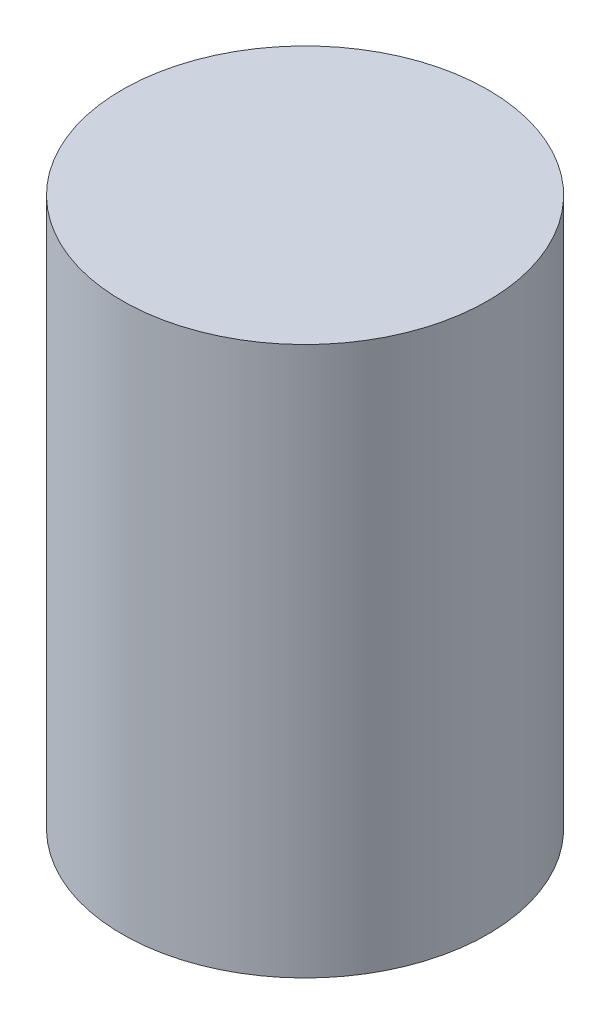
from build123d import *

# Parameters (mm, degrees)
SKETCH3_R           = 12.7
BOSS_EXTRUDE1_DEPTH = 9.525


with BuildPart() as part:
    # Sketch2 → Revolve1 (revolve)
    with BuildSketch(Plane(origin=(0, 0, 0), x_dir=(0, 0, -1), z_dir=(1, 0, 0))):
        Polygon((0, -508), (254, -508), (254, 254), (0, 254), (0, 247.65), (247.65, 247.65), (247.65, -501.65), (0, -501.65), align=None)
    revolve(axis=Axis((0, -508, 0), (0, 1, 0)))

    # Sketch3 → Boss-Extrude1 (add, symmetric)
    with BuildSketch(Plane(origin=(0, 0, 0), x_dir=(0, 0, -1), z_dir=(1, 0, 0))):
        Polygon((-50.8, -508), (-25.4, -558.8), (25.4, -558.8), (50.8, -508), align=None)
        with Locations(Location((0, -533.4, 0), (0, 0, 180))):
            Circle(SKETCH3_R, mode=Mode.SUBTRACT)
    extrude(amount=BOSS_EXTRUDE1_DEPTH, both=True)


solid = part.part
